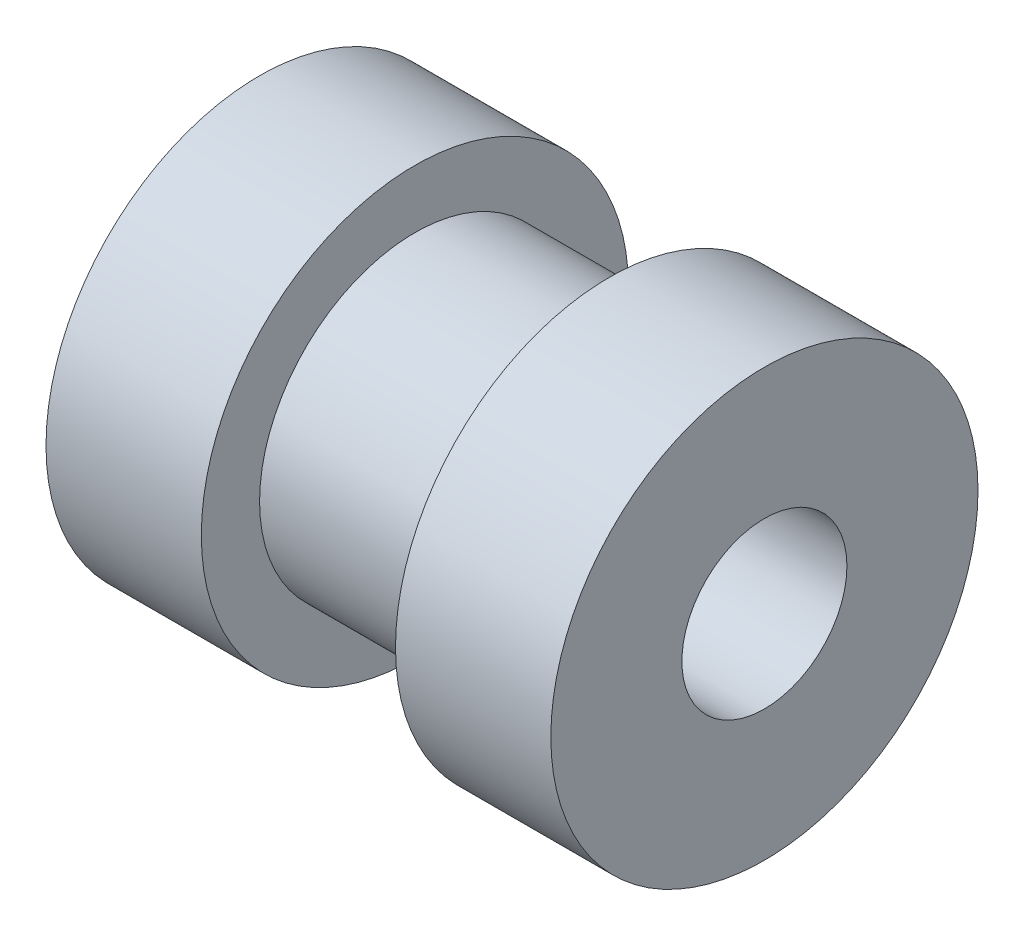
ISO-10303-21;
HEADER;
FILE_DESCRIPTION(('STEP AP214'),'2;1');
FILE_NAME('part.step','',(''),(''),'','','');
FILE_SCHEMA(('AUTOMOTIVE_DESIGN { 1 0 10303 214 1 1 1 1 }'));
ENDSEC;
DATA;
#1=APPLICATION_CONTEXT('core data for automotive mechanical design processes');
#2=APPLICATION_PROTOCOL_DEFINITION('international standard','automotive_design',2000,#1);
#3=PRODUCT_CONTEXT('',#1,'mechanical');
#4=PRODUCT('Part','Part','',(#3));
#5=PRODUCT_RELATED_PRODUCT_CATEGORY('part','',(#4));
#6=PRODUCT_DEFINITION_FORMATION('','',#4);
#7=PRODUCT_DEFINITION_CONTEXT('part definition',#1,'design');
#8=PRODUCT_DEFINITION('design','',#6,#7);
#9=PRODUCT_DEFINITION_SHAPE('','',#8);
#10=(LENGTH_UNIT() NAMED_UNIT(*) SI_UNIT(.MILLI.,.METRE.));
#11=(NAMED_UNIT(*) PLANE_ANGLE_UNIT() SI_UNIT($,.RADIAN.));
#12=(NAMED_UNIT(*) SI_UNIT($,.STERADIAN.) SOLID_ANGLE_UNIT());
#13=UNCERTAINTY_MEASURE_WITH_UNIT(LENGTH_MEASURE(1.E-05),#10,'distance_accuracy_value','');
#14=(GEOMETRIC_REPRESENTATION_CONTEXT(3) GLOBAL_UNCERTAINTY_ASSIGNED_CONTEXT((#13)) GLOBAL_UNIT_ASSIGNED_CONTEXT((#10,
#11,#12)) REPRESENTATION_CONTEXT('',''));
#15=CARTESIAN_POINT('',(0.,0.,0.));
#16=DIRECTION('',(0.,0.,1.));
#17=DIRECTION('',(1.,0.,0.));
#18=AXIS2_PLACEMENT_3D('',#15,#16,#17);
#19=CARTESIAN_POINT('',(55.,-23.,0.));
#20=DIRECTION('',(1.,0.,0.));
#21=DIRECTION('',(0.,0.,-1.));
#22=AXIS2_PLACEMENT_3D('',#19,#20,#21);
#23=PLANE('',#22);
#24=CARTESIAN_POINT('',(55.,-23.,0.));
#25=DIRECTION('',(1.,0.,0.));
#26=DIRECTION('',(0.,0.,-1.));
#27=AXIS2_PLACEMENT_3D('',#24,#25,#26);
#28=CIRCLE('',#27,4.25);
#29=CARTESIAN_POINT('',(55.,-23.,-4.25));
#30=VERTEX_POINT('',#29);
#31=EDGE_CURVE('E42',#30,#30,#28,.T.);
#32=ORIENTED_EDGE('',*,*,#31,.F.);
#33=EDGE_LOOP('',(#32));
#34=FACE_BOUND('',#33,.T.);
#35=CARTESIAN_POINT('',(55.,-23.,0.));
#36=DIRECTION('',(1.,0.,0.));
#37=DIRECTION('',(0.,0.,-1.));
#38=AXIS2_PLACEMENT_3D('',#35,#36,#37);
#39=CIRCLE('',#38,11.);
#40=CARTESIAN_POINT('',(55.,-23.,-11.));
#41=VERTEX_POINT('',#40);
#42=EDGE_CURVE('E10',#41,#41,#39,.T.);
#43=ORIENTED_EDGE('',*,*,#42,.T.);
#44=EDGE_LOOP('',(#43));
#45=FACE_BOUND('',#44,.T.);
#46=ADVANCED_FACE('F14',(#34,#45),#23,.T.);
#47=CARTESIAN_POINT('',(55.,-23.,0.));
#48=DIRECTION('',(1.,0.,0.));
#49=DIRECTION('',(0.,0.,-1.));
#50=AXIS2_PLACEMENT_3D('',#47,#48,#49);
#51=CYLINDRICAL_SURFACE('',#50,11.);
#52=CARTESIAN_POINT('',(47.,-23.,0.));
#53=DIRECTION('',(1.,0.,0.));
#54=DIRECTION('',(0.,0.,-1.));
#55=AXIS2_PLACEMENT_3D('',#52,#53,#54);
#56=CIRCLE('',#55,11.);
#57=CARTESIAN_POINT('',(47.,-23.,-11.));
#58=VERTEX_POINT('',#57);
#59=EDGE_CURVE('E20',#58,#58,#56,.T.);
#60=ORIENTED_EDGE('',*,*,#59,.T.);
#61=EDGE_LOOP('',(#60));
#62=FACE_BOUND('',#61,.T.);
#63=ORIENTED_EDGE('',*,*,#42,.F.);
#64=EDGE_LOOP('',(#63));
#65=FACE_BOUND('',#64,.T.);
#66=ADVANCED_FACE('F49',(#62,#65),#51,.T.);
#67=CARTESIAN_POINT('',(47.,-12.,0.));
#68=DIRECTION('',(-1.,0.,0.));
#69=DIRECTION('',(0.,0.,1.));
#70=AXIS2_PLACEMENT_3D('',#67,#68,#69);
#71=PLANE('',#70);
#72=CARTESIAN_POINT('',(47.,-23.,0.));
#73=DIRECTION('',(1.,0.,0.));
#74=DIRECTION('',(0.,0.,-1.));
#75=AXIS2_PLACEMENT_3D('',#72,#73,#74);
#76=CIRCLE('',#75,8.);
#77=CARTESIAN_POINT('',(47.,-23.,-8.));
#78=VERTEX_POINT('',#77);
#79=EDGE_CURVE('E24',#78,#78,#76,.T.);
#80=ORIENTED_EDGE('',*,*,#79,.T.);
#81=EDGE_LOOP('',(#80));
#82=FACE_BOUND('',#81,.T.);
#83=ORIENTED_EDGE('',*,*,#59,.F.);
#84=EDGE_LOOP('',(#83));
#85=FACE_BOUND('',#84,.T.);
#86=ADVANCED_FACE('F55',(#82,#85),#71,.T.);
#87=CARTESIAN_POINT('',(55.,-23.,0.));
#88=DIRECTION('',(1.,0.,0.));
#89=DIRECTION('',(0.,0.,-1.));
#90=AXIS2_PLACEMENT_3D('',#87,#88,#89);
#91=CYLINDRICAL_SURFACE('',#90,8.);
#92=CARTESIAN_POINT('',(37.,-23.,0.));
#93=DIRECTION('',(1.,0.,0.));
#94=DIRECTION('',(0.,0.,-1.));
#95=AXIS2_PLACEMENT_3D('',#92,#93,#94);
#96=CIRCLE('',#95,8.);
#97=CARTESIAN_POINT('',(37.,-23.,-8.));
#98=VERTEX_POINT('',#97);
#99=EDGE_CURVE('E28',#98,#98,#96,.T.);
#100=ORIENTED_EDGE('',*,*,#99,.T.);
#101=EDGE_LOOP('',(#100));
#102=FACE_BOUND('',#101,.T.);
#103=ORIENTED_EDGE('',*,*,#79,.F.);
#104=EDGE_LOOP('',(#103));
#105=FACE_BOUND('',#104,.T.);
#106=ADVANCED_FACE('F60',(#102,#105),#91,.T.);
#107=CARTESIAN_POINT('',(37.,-15.,0.));
#108=DIRECTION('',(1.,0.,0.));
#109=DIRECTION('',(0.,0.,-1.));
#110=AXIS2_PLACEMENT_3D('',#107,#108,#109);
#111=PLANE('',#110);
#112=CARTESIAN_POINT('',(37.,-23.,0.));
#113=DIRECTION('',(1.,0.,0.));
#114=DIRECTION('',(0.,0.,-1.));
#115=AXIS2_PLACEMENT_3D('',#112,#113,#114);
#116=CIRCLE('',#115,11.);
#117=CARTESIAN_POINT('',(37.,-23.,-11.));
#118=VERTEX_POINT('',#117);
#119=EDGE_CURVE('E33',#118,#118,#116,.T.);
#120=ORIENTED_EDGE('',*,*,#119,.T.);
#121=EDGE_LOOP('',(#120));
#122=FACE_BOUND('',#121,.T.);
#123=ORIENTED_EDGE('',*,*,#99,.F.);
#124=EDGE_LOOP('',(#123));
#125=FACE_BOUND('',#124,.T.);
#126=ADVANCED_FACE('F67',(#122,#125),#111,.T.);
#127=CARTESIAN_POINT('',(55.,-23.,0.));
#128=DIRECTION('',(1.,0.,0.));
#129=DIRECTION('',(0.,0.,-1.));
#130=AXIS2_PLACEMENT_3D('',#127,#128,#129);
#131=CYLINDRICAL_SURFACE('',#130,11.);
#132=CARTESIAN_POINT('',(29.,-23.,0.));
#133=DIRECTION('',(1.,0.,0.));
#134=DIRECTION('',(0.,0.,-1.));
#135=AXIS2_PLACEMENT_3D('',#132,#133,#134);
#136=CIRCLE('',#135,11.);
#137=CARTESIAN_POINT('',(29.,-23.,-11.));
#138=VERTEX_POINT('',#137);
#139=EDGE_CURVE('E36',#138,#138,#136,.T.);
#140=ORIENTED_EDGE('',*,*,#139,.T.);
#141=EDGE_LOOP('',(#140));
#142=FACE_BOUND('',#141,.T.);
#143=ORIENTED_EDGE('',*,*,#119,.F.);
#144=EDGE_LOOP('',(#143));
#145=FACE_BOUND('',#144,.T.);
#146=ADVANCED_FACE('F71',(#142,#145),#131,.T.);
#147=CARTESIAN_POINT('',(29.,-12.0000000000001,0.));
#148=DIRECTION('',(-1.,0.,0.));
#149=DIRECTION('',(0.,0.,1.));
#150=AXIS2_PLACEMENT_3D('',#147,#148,#149);
#151=PLANE('',#150);
#152=CARTESIAN_POINT('',(29.,-23.,0.));
#153=DIRECTION('',(1.,0.,0.));
#154=DIRECTION('',(0.,0.,-1.));
#155=AXIS2_PLACEMENT_3D('',#152,#153,#154);
#156=CIRCLE('',#155,4.25);
#157=CARTESIAN_POINT('',(29.,-23.,-4.25));
#158=VERTEX_POINT('',#157);
#159=EDGE_CURVE('E39',#158,#158,#156,.T.);
#160=ORIENTED_EDGE('',*,*,#159,.T.);
#161=EDGE_LOOP('',(#160));
#162=FACE_BOUND('',#161,.T.);
#163=ORIENTED_EDGE('',*,*,#139,.F.);
#164=EDGE_LOOP('',(#163));
#165=FACE_BOUND('',#164,.T.);
#166=ADVANCED_FACE('F75',(#162,#165),#151,.T.);
#167=CARTESIAN_POINT('',(55.,-23.,0.));
#168=DIRECTION('',(1.,0.,0.));
#169=DIRECTION('',(0.,0.,-1.));
#170=AXIS2_PLACEMENT_3D('',#167,#168,#169);
#171=CYLINDRICAL_SURFACE('',#170,4.25);
#172=ORIENTED_EDGE('',*,*,#159,.F.);
#173=EDGE_LOOP('',(#172));
#174=FACE_BOUND('',#173,.T.);
#175=ORIENTED_EDGE('',*,*,#31,.T.);
#176=EDGE_LOOP('',(#175));
#177=FACE_BOUND('',#176,.T.);
#178=ADVANCED_FACE('F46',(#174,#177),#171,.F.);
#179=CLOSED_SHELL('',(#46,#66,#86,#106,#126,#146,#166,#178));
#180=MANIFOLD_SOLID_BREP('B1',#179);
#181=ADVANCED_BREP_SHAPE_REPRESENTATION('',(#18,#180),#14);
#182=SHAPE_DEFINITION_REPRESENTATION(#9,#181);
ENDSEC;
END-ISO-10303-21;
